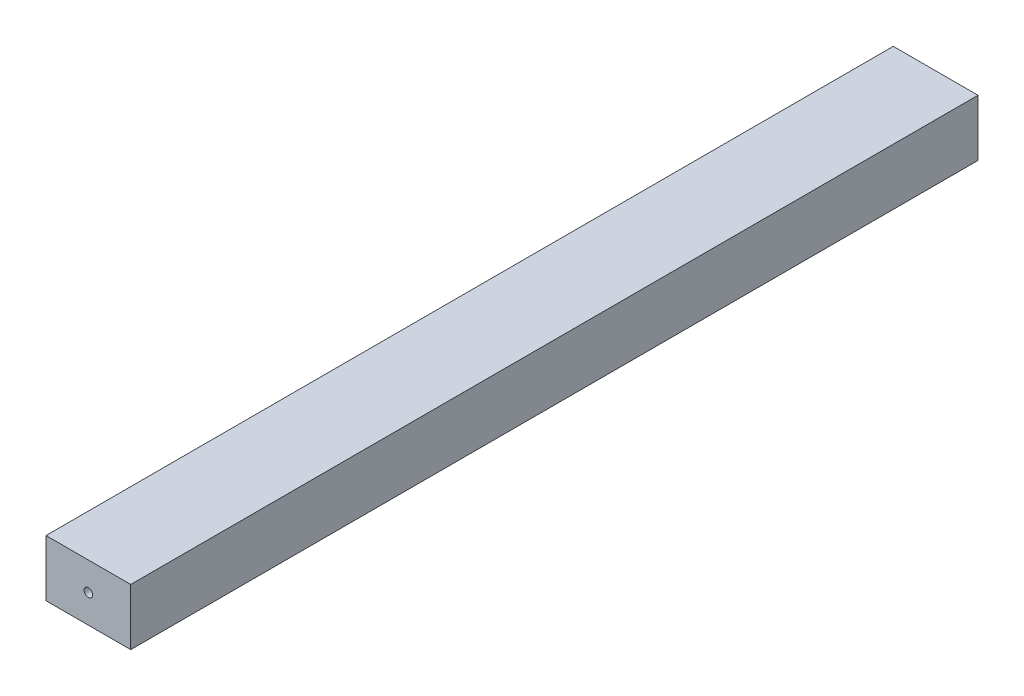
ISO-10303-21;
HEADER;
FILE_DESCRIPTION(('STEP AP214'),'2;1');
FILE_NAME('part.step','',(''),(''),'','','');
FILE_SCHEMA(('AUTOMOTIVE_DESIGN { 1 0 10303 214 1 1 1 1 }'));
ENDSEC;
DATA;
#1=APPLICATION_CONTEXT('core data for automotive mechanical design processes');
#2=APPLICATION_PROTOCOL_DEFINITION('international standard','automotive_design',2000,#1);
#3=PRODUCT_CONTEXT('',#1,'mechanical');
#4=PRODUCT('Part','Part','',(#3));
#5=PRODUCT_RELATED_PRODUCT_CATEGORY('part','',(#4));
#6=PRODUCT_DEFINITION_FORMATION('','',#4);
#7=PRODUCT_DEFINITION_CONTEXT('part definition',#1,'design');
#8=PRODUCT_DEFINITION('design','',#6,#7);
#9=PRODUCT_DEFINITION_SHAPE('','',#8);
#10=(LENGTH_UNIT() NAMED_UNIT(*) SI_UNIT(.MILLI.,.METRE.));
#11=(NAMED_UNIT(*) PLANE_ANGLE_UNIT() SI_UNIT($,.RADIAN.));
#12=(NAMED_UNIT(*) SI_UNIT($,.STERADIAN.) SOLID_ANGLE_UNIT());
#13=UNCERTAINTY_MEASURE_WITH_UNIT(LENGTH_MEASURE(1.E-05),#10,'distance_accuracy_value','');
#14=(GEOMETRIC_REPRESENTATION_CONTEXT(3) GLOBAL_UNCERTAINTY_ASSIGNED_CONTEXT((#13)) GLOBAL_UNIT_ASSIGNED_CONTEXT((#10,
#11,#12)) REPRESENTATION_CONTEXT('',''));
#15=CARTESIAN_POINT('',(0.,0.,0.));
#16=DIRECTION('',(0.,0.,1.));
#17=DIRECTION('',(1.,0.,0.));
#18=AXIS2_PLACEMENT_3D('',#15,#16,#17);
#19=CARTESIAN_POINT('',(0.,0.,600.));
#20=DIRECTION('',(0.,0.,1.));
#21=DIRECTION('',(1.,0.,0.));
#22=AXIS2_PLACEMENT_3D('',#19,#20,#21);
#23=PLANE('',#22);
#24=DIRECTION('',(0.,-1.,0.));
#25=VECTOR('',#24,1.);
#26=CARTESIAN_POINT('',(-30.,-20.,600.));
#27=LINE('',#26,#25);
#28=CARTESIAN_POINT('',(-30.,20.,600.));
#29=VERTEX_POINT('',#28);
#30=CARTESIAN_POINT('',(-30.,-20.,600.));
#31=VERTEX_POINT('',#30);
#32=EDGE_CURVE('E85',#29,#31,#27,.T.);
#33=ORIENTED_EDGE('',*,*,#32,.T.);
#34=DIRECTION('',(1.,0.,0.));
#35=VECTOR('',#34,1.);
#36=CARTESIAN_POINT('',(30.,-20.,600.));
#37=LINE('',#36,#35);
#38=CARTESIAN_POINT('',(30.,-20.,600.));
#39=VERTEX_POINT('',#38);
#40=EDGE_CURVE('E80',#31,#39,#37,.T.);
#41=ORIENTED_EDGE('',*,*,#40,.T.);
#42=DIRECTION('',(0.,1.,0.));
#43=VECTOR('',#42,1.);
#44=CARTESIAN_POINT('',(30.,-20.,600.));
#45=LINE('',#44,#43);
#46=CARTESIAN_POINT('',(30.,20.,600.));
#47=VERTEX_POINT('',#46);
#48=EDGE_CURVE('E83',#39,#47,#45,.T.);
#49=ORIENTED_EDGE('',*,*,#48,.T.);
#50=DIRECTION('',(-1.,0.,0.));
#51=VECTOR('',#50,1.);
#52=CARTESIAN_POINT('',(30.,20.,600.));
#53=LINE('',#52,#51);
#54=EDGE_CURVE('E50',#47,#29,#53,.T.);
#55=ORIENTED_EDGE('',*,*,#54,.T.);
#56=EDGE_LOOP('',(#33,#41,#49,#55));
#57=FACE_BOUND('',#56,.T.);
#58=CARTESIAN_POINT('',(0.,0.,600.));
#59=DIRECTION('',(0.,0.,1.));
#60=DIRECTION('',(1.,0.,0.));
#61=AXIS2_PLACEMENT_3D('',#58,#59,#60);
#62=CIRCLE('',#61,3.);
#63=CARTESIAN_POINT('',(3.,0.,600.));
#64=VERTEX_POINT('',#63);
#65=EDGE_CURVE('E100',#64,#64,#62,.T.);
#66=ORIENTED_EDGE('',*,*,#65,.F.);
#67=EDGE_LOOP('',(#66));
#68=FACE_BOUND('',#67,.T.);
#69=ADVANCED_FACE('F33',(#57,#68),#23,.T.);
#70=CARTESIAN_POINT('',(0.,0.,0.));
#71=DIRECTION('',(0.,0.,1.));
#72=DIRECTION('',(1.,0.,0.));
#73=AXIS2_PLACEMENT_3D('',#70,#71,#72);
#74=PLANE('',#73);
#75=DIRECTION('',(0.,-1.,0.));
#76=VECTOR('',#75,1.);
#77=CARTESIAN_POINT('',(-30.,-20.,0.));
#78=LINE('',#77,#76);
#79=CARTESIAN_POINT('',(-30.,20.,0.));
#80=VERTEX_POINT('',#79);
#81=CARTESIAN_POINT('',(-30.,-20.,0.));
#82=VERTEX_POINT('',#81);
#83=EDGE_CURVE('E97',#80,#82,#78,.T.);
#84=ORIENTED_EDGE('',*,*,#83,.F.);
#85=DIRECTION('',(-1.,0.,0.));
#86=VECTOR('',#85,1.);
#87=CARTESIAN_POINT('',(30.,20.,0.));
#88=LINE('',#87,#86);
#89=CARTESIAN_POINT('',(30.,20.,0.));
#90=VERTEX_POINT('',#89);
#91=EDGE_CURVE('E73',#90,#80,#88,.T.);
#92=ORIENTED_EDGE('',*,*,#91,.F.);
#93=DIRECTION('',(0.,1.,0.));
#94=VECTOR('',#93,1.);
#95=CARTESIAN_POINT('',(30.,-20.,0.));
#96=LINE('',#95,#94);
#97=CARTESIAN_POINT('',(30.,-20.,0.));
#98=VERTEX_POINT('',#97);
#99=EDGE_CURVE('E67',#98,#90,#96,.T.);
#100=ORIENTED_EDGE('',*,*,#99,.F.);
#101=DIRECTION('',(1.,0.,0.));
#102=VECTOR('',#101,1.);
#103=CARTESIAN_POINT('',(30.,-20.,0.));
#104=LINE('',#103,#102);
#105=EDGE_CURVE('E89',#82,#98,#104,.T.);
#106=ORIENTED_EDGE('',*,*,#105,.F.);
#107=EDGE_LOOP('',(#84,#92,#100,#106));
#108=FACE_BOUND('',#107,.T.);
#109=CARTESIAN_POINT('',(0.,0.,0.));
#110=DIRECTION('',(0.,0.,1.));
#111=DIRECTION('',(1.,0.,0.));
#112=AXIS2_PLACEMENT_3D('',#109,#110,#111);
#113=CIRCLE('',#112,3.);
#114=CARTESIAN_POINT('',(3.,0.,0.));
#115=VERTEX_POINT('',#114);
#116=EDGE_CURVE('E112',#115,#115,#113,.T.);
#117=ORIENTED_EDGE('',*,*,#116,.T.);
#118=EDGE_LOOP('',(#117));
#119=FACE_BOUND('',#118,.T.);
#120=ADVANCED_FACE('F108',(#108,#119),#74,.F.);
#121=CARTESIAN_POINT('',(-30.,-20.,600.));
#122=DIRECTION('',(1.,0.,0.));
#123=DIRECTION('',(0.,0.,-1.));
#124=AXIS2_PLACEMENT_3D('',#121,#122,#123);
#125=PLANE('',#124);
#126=ORIENTED_EDGE('',*,*,#83,.T.);
#127=DIRECTION('',(0.,0.,-1.));
#128=VECTOR('',#127,1.);
#129=CARTESIAN_POINT('',(-30.,-20.,600.));
#130=LINE('',#129,#128);
#131=EDGE_CURVE('E11',#31,#82,#130,.T.);
#132=ORIENTED_EDGE('',*,*,#131,.F.);
#133=ORIENTED_EDGE('',*,*,#32,.F.);
#134=DIRECTION('',(0.,0.,-1.));
#135=VECTOR('',#134,1.);
#136=CARTESIAN_POINT('',(-30.,20.,600.));
#137=LINE('',#136,#135);
#138=EDGE_CURVE('E93',#29,#80,#137,.T.);
#139=ORIENTED_EDGE('',*,*,#138,.T.);
#140=EDGE_LOOP('',(#126,#132,#133,#139));
#141=FACE_BOUND('',#140,.T.);
#142=ADVANCED_FACE('F35',(#141),#125,.F.);
#143=CARTESIAN_POINT('',(30.,-20.,600.));
#144=DIRECTION('',(0.,1.,0.));
#145=DIRECTION('',(-1.,0.,0.));
#146=AXIS2_PLACEMENT_3D('',#143,#144,#145);
#147=PLANE('',#146);
#148=ORIENTED_EDGE('',*,*,#105,.T.);
#149=DIRECTION('',(0.,0.,-1.));
#150=VECTOR('',#149,1.);
#151=CARTESIAN_POINT('',(30.,-20.,600.));
#152=LINE('',#151,#150);
#153=EDGE_CURVE('E42',#39,#98,#152,.T.);
#154=ORIENTED_EDGE('',*,*,#153,.F.);
#155=ORIENTED_EDGE('',*,*,#40,.F.);
#156=ORIENTED_EDGE('',*,*,#131,.T.);
#157=EDGE_LOOP('',(#148,#154,#155,#156));
#158=FACE_BOUND('',#157,.T.);
#159=ADVANCED_FACE('F88',(#158),#147,.F.);
#160=CARTESIAN_POINT('',(30.,-20.,600.));
#161=DIRECTION('',(-1.,0.,0.));
#162=DIRECTION('',(0.,0.,1.));
#163=AXIS2_PLACEMENT_3D('',#160,#161,#162);
#164=PLANE('',#163);
#165=ORIENTED_EDGE('',*,*,#99,.T.);
#166=DIRECTION('',(0.,0.,-1.));
#167=VECTOR('',#166,1.);
#168=CARTESIAN_POINT('',(30.,20.,600.));
#169=LINE('',#168,#167);
#170=EDGE_CURVE('E90',#47,#90,#169,.T.);
#171=ORIENTED_EDGE('',*,*,#170,.F.);
#172=ORIENTED_EDGE('',*,*,#48,.F.);
#173=ORIENTED_EDGE('',*,*,#153,.T.);
#174=EDGE_LOOP('',(#165,#171,#172,#173));
#175=FACE_BOUND('',#174,.T.);
#176=ADVANCED_FACE('F91',(#175),#164,.F.);
#177=CARTESIAN_POINT('',(30.,20.,600.));
#178=DIRECTION('',(0.,-1.,0.));
#179=DIRECTION('',(1.,0.,0.));
#180=AXIS2_PLACEMENT_3D('',#177,#178,#179);
#181=PLANE('',#180);
#182=ORIENTED_EDGE('',*,*,#91,.T.);
#183=ORIENTED_EDGE('',*,*,#138,.F.);
#184=ORIENTED_EDGE('',*,*,#54,.F.);
#185=ORIENTED_EDGE('',*,*,#170,.T.);
#186=EDGE_LOOP('',(#182,#183,#184,#185));
#187=FACE_BOUND('',#186,.T.);
#188=ADVANCED_FACE('F105',(#187),#181,.F.);
#189=CARTESIAN_POINT('',(0.,0.,600.));
#190=DIRECTION('',(0.,0.,-1.));
#191=DIRECTION('',(-1.,0.,0.));
#192=AXIS2_PLACEMENT_3D('',#189,#190,#191);
#193=CYLINDRICAL_SURFACE('',#192,3.);
#194=ORIENTED_EDGE('',*,*,#65,.T.);
#195=EDGE_LOOP('',(#194));
#196=FACE_BOUND('',#195,.T.);
#197=ORIENTED_EDGE('',*,*,#116,.F.);
#198=EDGE_LOOP('',(#197));
#199=FACE_BOUND('',#198,.T.);
#200=ADVANCED_FACE('F118',(#196,#199),#193,.F.);
#201=CLOSED_SHELL('',(#69,#120,#142,#159,#176,#188,#200));
#202=MANIFOLD_SOLID_BREP('B2',#201);
#203=ADVANCED_BREP_SHAPE_REPRESENTATION('',(#18,#202),#14);
#204=SHAPE_DEFINITION_REPRESENTATION(#9,#203);
ENDSEC;
END-ISO-10303-21;
